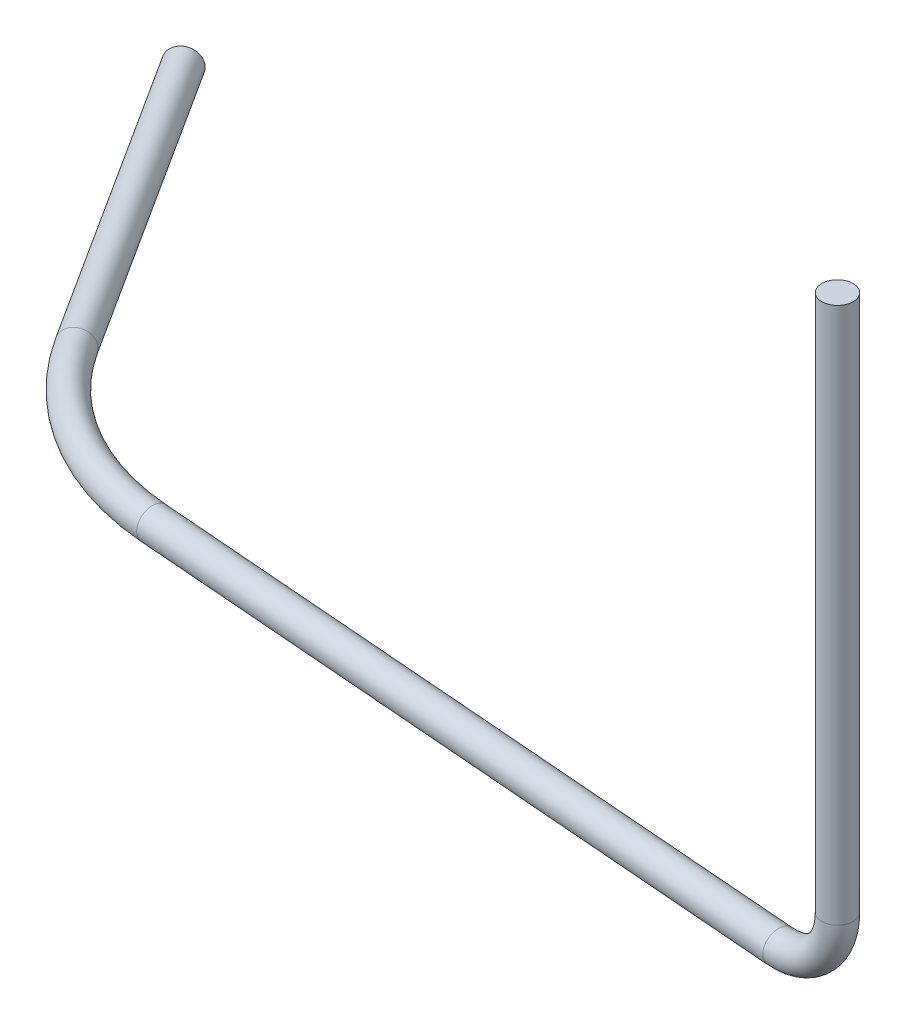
ISO-10303-21;
HEADER;
FILE_DESCRIPTION(('STEP AP214'),'2;1');
FILE_NAME('part.step','',(''),(''),'','','');
FILE_SCHEMA(('AUTOMOTIVE_DESIGN { 1 0 10303 214 1 1 1 1 }'));
ENDSEC;
DATA;
#1=APPLICATION_CONTEXT('core data for automotive mechanical design processes');
#2=APPLICATION_PROTOCOL_DEFINITION('international standard','automotive_design',2000,#1);
#3=PRODUCT_CONTEXT('',#1,'mechanical');
#4=PRODUCT('Part','Part','',(#3));
#5=PRODUCT_RELATED_PRODUCT_CATEGORY('part','',(#4));
#6=PRODUCT_DEFINITION_FORMATION('','',#4);
#7=PRODUCT_DEFINITION_CONTEXT('part definition',#1,'design');
#8=PRODUCT_DEFINITION('design','',#6,#7);
#9=PRODUCT_DEFINITION_SHAPE('','',#8);
#10=(LENGTH_UNIT() NAMED_UNIT(*) SI_UNIT(.MILLI.,.METRE.));
#11=(NAMED_UNIT(*) PLANE_ANGLE_UNIT() SI_UNIT($,.RADIAN.));
#12=(NAMED_UNIT(*) SI_UNIT($,.STERADIAN.) SOLID_ANGLE_UNIT());
#13=UNCERTAINTY_MEASURE_WITH_UNIT(LENGTH_MEASURE(1.E-05),#10,'distance_accuracy_value','');
#14=(GEOMETRIC_REPRESENTATION_CONTEXT(3) GLOBAL_UNCERTAINTY_ASSIGNED_CONTEXT((#13)) GLOBAL_UNIT_ASSIGNED_CONTEXT((#10,
#11,#12)) REPRESENTATION_CONTEXT('',''));
#15=CARTESIAN_POINT('',(0.,0.,0.));
#16=DIRECTION('',(0.,0.,1.));
#17=DIRECTION('',(1.,0.,0.));
#18=AXIS2_PLACEMENT_3D('',#15,#16,#17);
#19=CARTESIAN_POINT('',(-10.897666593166,-3.53999999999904,5.67949403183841));
#20=DIRECTION('',(-0.539084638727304,0.,-0.842251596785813));
#21=DIRECTION('',(-0.842251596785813,0.,0.539084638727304));
#22=AXIS2_PLACEMENT_3D('',#19,#20,#21);
#23=CYLINDRICAL_SURFACE('',#22,0.25);
#24=CARTESIAN_POINT('',(-10.897666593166,-3.53999999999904,5.67949403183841));
#25=DIRECTION('',(-0.539084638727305,0.,-0.842251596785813));
#26=DIRECTION('',(0.0657510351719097,-0.996948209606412,-0.0420840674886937));
#27=AXIS2_PLACEMENT_3D('',#24,#25,#26);
#28=CIRCLE('',#27,0.25);
#29=CARTESIAN_POINT('',(-11.1082294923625,-3.53999999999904,5.81426519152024));
#30=VERTEX_POINT('',#29);
#31=EDGE_CURVE('E30',#30,#30,#28,.T.);
#32=ORIENTED_EDGE('',*,*,#31,.T.);
#33=EDGE_LOOP('',(#32));
#34=FACE_BOUND('',#33,.T.);
#35=CARTESIAN_POINT('',(-13.9229369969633,-3.53999999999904,0.952891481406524));
#36=DIRECTION('',(-0.539084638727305,0.,-0.842251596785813));
#37=DIRECTION('',(0.0657510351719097,-0.996948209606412,-0.0420840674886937));
#38=AXIS2_PLACEMENT_3D('',#35,#36,#37);
#39=CIRCLE('',#38,0.25);
#40=CARTESIAN_POINT('',(-13.9064992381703,-3.78923705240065,0.942370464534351));
#41=VERTEX_POINT('',#40);
#42=EDGE_CURVE('E10',#41,#41,#39,.T.);
#43=ORIENTED_EDGE('',*,*,#42,.F.);
#44=EDGE_LOOP('',(#43));
#45=FACE_BOUND('',#44,.T.);
#46=ADVANCED_FACE('F24',(#34,#45),#23,.T.);
#47=CARTESIAN_POINT('',(-7.52866020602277,-3.53999999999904,3.5231554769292));
#48=DIRECTION('',(0.,-1.,0.));
#49=DIRECTION('',(0.,0.,-1.));
#50=AXIS2_PLACEMENT_3D('',#47,#48,#49);
#51=TOROIDAL_SURFACE('',#50,4.,0.25);
#52=CARTESIAN_POINT('',(-7.84092336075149,-3.53999999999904,7.51094831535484));
#53=DIRECTION('',(-0.996948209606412,0.,-0.078065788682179));
#54=DIRECTION('',(0.00609426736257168,-0.996948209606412,-0.0778275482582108));
#55=AXIS2_PLACEMENT_3D('',#52,#53,#54);
#56=CIRCLE('',#55,0.25);
#57=CARTESIAN_POINT('',(-7.86043980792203,-3.53999999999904,7.76018536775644));
#58=VERTEX_POINT('',#57);
#59=EDGE_CURVE('E34',#58,#58,#56,.T.);
#60=CARTESIAN_POINT('',(-7.52866020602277,-3.53999999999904,3.5231554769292));
#61=DIRECTION('',(0.,-1.,0.));
#62=DIRECTION('',(0.,0.,-1.));
#63=AXIS2_PLACEMENT_3D('',#60,#61,#62);
#64=CIRCLE('',#63,4.25);
#65=EDGE_CURVE('',#58,#30,#64,.T.);
#66=ORIENTED_EDGE('',*,*,#59,.T.);
#67=ORIENTED_EDGE('',*,*,#31,.F.);
#68=ORIENTED_EDGE('',*,*,#65,.T.);
#69=ORIENTED_EDGE('',*,*,#65,.F.);
#70=EDGE_LOOP('',(#66,#68,#67,#69));
#71=FACE_BOUND('',#70,.T.);
#72=ADVANCED_FACE('F61',(#71),#51,.T.);
#73=CARTESIAN_POINT('',(2.96727574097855,-3.53999999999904,8.35728173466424));
#74=DIRECTION('',(-0.996948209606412,0.,-0.0780657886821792));
#75=DIRECTION('',(-0.0780657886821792,0.,0.996948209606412));
#76=AXIS2_PLACEMENT_3D('',#73,#74,#75);
#77=CYLINDRICAL_SURFACE('',#76,0.25);
#78=CARTESIAN_POINT('',(2.96727574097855,-3.53999999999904,8.35728173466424));
#79=DIRECTION('',(-0.996948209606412,0.,-0.078065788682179));
#80=DIRECTION('',(0.00609426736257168,-0.996948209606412,-0.0778275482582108));
#81=AXIS2_PLACEMENT_3D('',#78,#79,#80);
#82=CIRCLE('',#81,0.25);
#83=CARTESIAN_POINT('',(2.96727574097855,-3.78999999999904,8.35728173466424));
#84=VERTEX_POINT('',#83);
#85=EDGE_CURVE('E38',#84,#84,#82,.T.);
#86=ORIENTED_EDGE('',*,*,#85,.T.);
#87=EDGE_LOOP('',(#86));
#88=FACE_BOUND('',#87,.T.);
#89=ORIENTED_EDGE('',*,*,#59,.F.);
#90=EDGE_LOOP('',(#89));
#91=FACE_BOUND('',#90,.T.);
#92=ADVANCED_FACE('F65',(#88,#91),#77,.T.);
#93=CARTESIAN_POINT('',(2.96727574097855,-2.53999999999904,8.35728173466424));
#94=DIRECTION('',(0.078065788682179,0.,-0.996948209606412));
#95=DIRECTION('',(-0.996948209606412,0.,-0.078065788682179));
#96=AXIS2_PLACEMENT_3D('',#93,#94,#95);
#97=TOROIDAL_SURFACE('',#96,1.,0.25);
#98=CARTESIAN_POINT('',(3.96422395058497,-2.53999999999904,8.43534752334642));
#99=DIRECTION('',(0.,-1.,0.));
#100=DIRECTION('',(1.,0.,0.));
#101=AXIS2_PLACEMENT_3D('',#98,#99,#100);
#102=CIRCLE('',#101,0.25);
#103=CARTESIAN_POINT('',(4.21346100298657,-2.53999999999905,8.45486397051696));
#104=VERTEX_POINT('',#103);
#105=EDGE_CURVE('E43',#104,#104,#102,.T.);
#106=CARTESIAN_POINT('',(2.96727574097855,-2.53999999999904,8.35728173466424));
#107=DIRECTION('',(0.078065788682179,0.,-0.996948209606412));
#108=DIRECTION('',(-0.996948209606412,0.,-0.078065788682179));
#109=AXIS2_PLACEMENT_3D('',#106,#107,#108);
#110=CIRCLE('',#109,1.25);
#111=EDGE_CURVE('',#104,#84,#110,.T.);
#112=ORIENTED_EDGE('',*,*,#105,.T.);
#113=ORIENTED_EDGE('',*,*,#85,.F.);
#114=ORIENTED_EDGE('',*,*,#111,.T.);
#115=ORIENTED_EDGE('',*,*,#111,.F.);
#116=EDGE_LOOP('',(#112,#114,#113,#115));
#117=FACE_BOUND('',#116,.T.);
#118=ADVANCED_FACE('F71',(#117),#97,.T.);
#119=CARTESIAN_POINT('',(3.96422395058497,-2.53999999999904,8.43534752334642));
#120=DIRECTION('',(0.,1.,0.));
#121=DIRECTION('',(-1.,0.,0.));
#122=AXIS2_PLACEMENT_3D('',#119,#120,#121);
#123=CYLINDRICAL_SURFACE('',#122,0.25);
#124=ORIENTED_EDGE('',*,*,#105,.F.);
#125=EDGE_LOOP('',(#124));
#126=FACE_BOUND('',#125,.T.);
#127=CARTESIAN_POINT('',(3.96422395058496,6.,8.43534752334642));
#128=DIRECTION('',(0.,-1.,0.));
#129=DIRECTION('',(1.,0.,0.));
#130=AXIS2_PLACEMENT_3D('',#127,#128,#129);
#131=CIRCLE('',#130,0.25);
#132=CARTESIAN_POINT('',(4.21422395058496,6.,8.43534752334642));
#133=VERTEX_POINT('',#132);
#134=EDGE_CURVE('E46',#133,#133,#131,.T.);
#135=ORIENTED_EDGE('',*,*,#134,.T.);
#136=EDGE_LOOP('',(#135));
#137=FACE_BOUND('',#136,.T.);
#138=ADVANCED_FACE('F50',(#126,#137),#123,.T.);
#139=CARTESIAN_POINT('',(-13.9229369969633,-3.53999999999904,0.952891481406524));
#140=DIRECTION('',(-0.539084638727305,0.,-0.842251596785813));
#141=DIRECTION('',(0.0657510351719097,-0.996948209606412,-0.0420840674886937));
#142=AXIS2_PLACEMENT_3D('',#139,#140,#141);
#143=PLANE('',#142);
#144=ORIENTED_EDGE('',*,*,#42,.T.);
#145=EDGE_LOOP('',(#144));
#146=FACE_BOUND('',#145,.T.);
#147=ADVANCED_FACE('F54',(#146),#143,.T.);
#148=CARTESIAN_POINT('',(3.96422395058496,6.,8.43534752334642));
#149=DIRECTION('',(0.,-1.,0.));
#150=DIRECTION('',(1.,0.,0.));
#151=AXIS2_PLACEMENT_3D('',#148,#149,#150);
#152=PLANE('',#151);
#153=ORIENTED_EDGE('',*,*,#134,.F.);
#154=EDGE_LOOP('',(#153));
#155=FACE_BOUND('',#154,.T.);
#156=ADVANCED_FACE('F52',(#155),#152,.F.);
#157=CLOSED_SHELL('',(#46,#72,#92,#118,#138,#147,#156));
#158=MANIFOLD_SOLID_BREP('B2',#157);
#159=ADVANCED_BREP_SHAPE_REPRESENTATION('',(#18,#158),#14);
#160=SHAPE_DEFINITION_REPRESENTATION(#9,#159);
ENDSEC;
END-ISO-10303-21;
